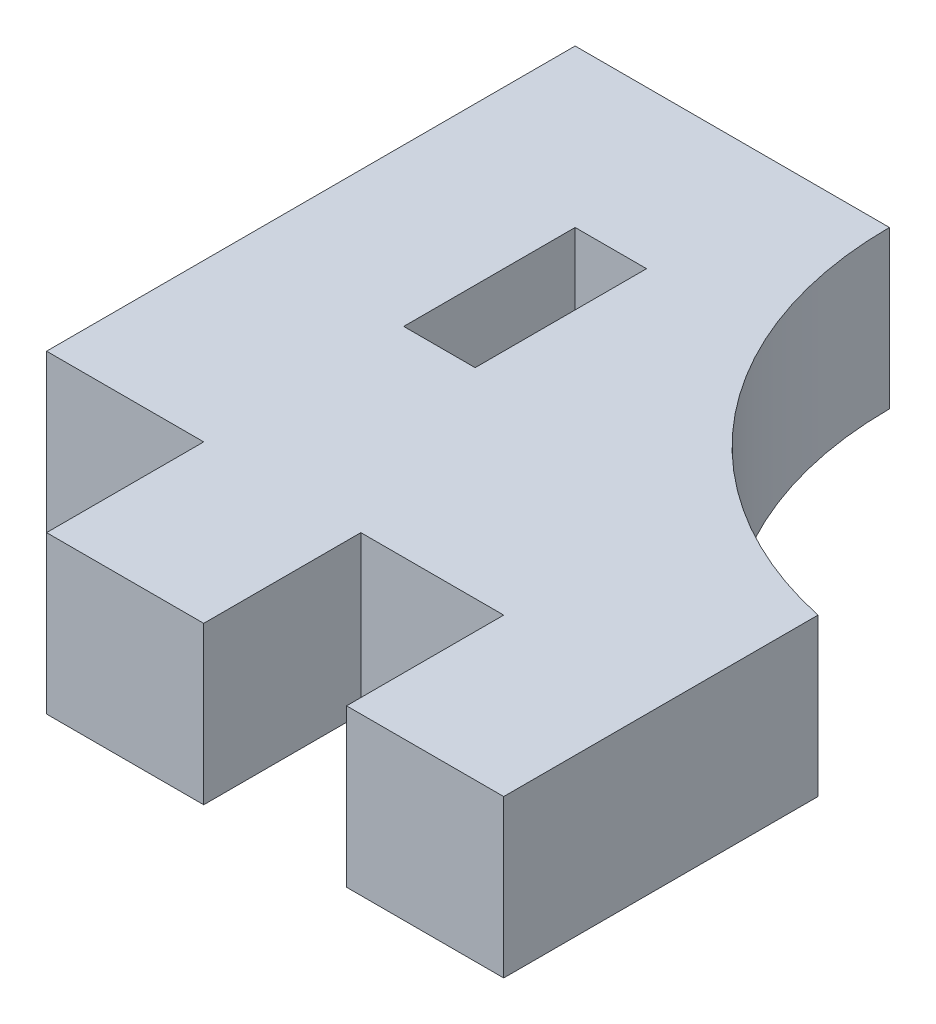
from build123d import *

# Parameters (mm, degrees)
SKETCH1_W           = 2.5
SKETCH1_H           = 6
BOSS_EXTRUDE1_DEPTH = 5.5


with BuildPart() as part:
    # Sketch1 → Boss-Extrude1 (new body)
    with BuildSketch(Plane(origin=(0, 0, 0), x_dir=(1, 0, 0), z_dir=(0, 1, 0))):
        with BuildLine():
            Line((-10.5, 24), (-21.5, 24))
            Line((-21.5, 24), (-21.5, 5.5))
            Line((-21.5, 5.5), (-16, 5.5))
            Line((-16, 5.5), (-16, 0))
            Line((-16, 0), (-10.5, 0))
            Line((-10.5, 0), (-10.5, 5.5))
            Line((-10.5, 5.5), (-5.5, 5.5))
            Line((-5.5, 5.5), (-5.5, 0))
            Line((-5.5, 0), (0, 0))
            Line((0, 0), (0, 5.5))
            Line((0, 5.5), (0, 11))
            ThreePointArc((0, 11), (-7.547146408, 15.644612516), (-10.5, 24))
        make_face()
        with Locations((-14.75, 15.5)):
            Rectangle(SKETCH1_W, SKETCH1_H, mode=Mode.SUBTRACT)
    extrude(amount=BOSS_EXTRUDE1_DEPTH)


solid = part.part
